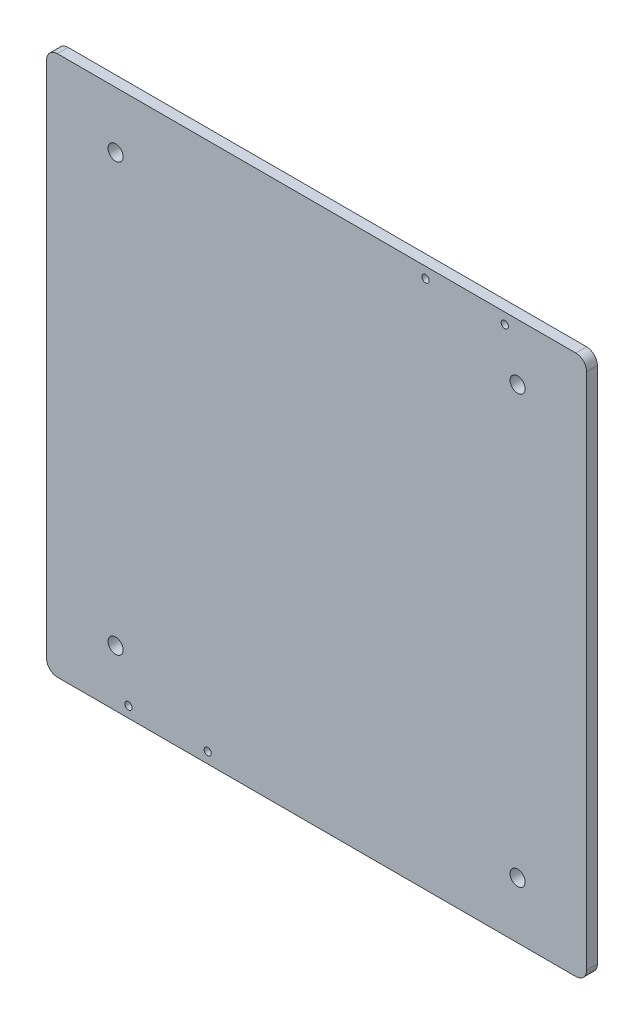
from build123d import *

# Parameters (mm, degrees)
SKETCH1_W           = 150
SKETCH1_H           = 150
BOSS_EXTRUDE1_DEPTH = 3
FILLET1_R           = 3
SKETCH2_R           = 2.1
CUT_EXTRUDE1_DEPTH  = 3
SKETCH3_R           = 1
CUT_EXTRUDE2_DEPTH  = 3


with BuildPart() as part:
    # Sketch1 → Boss-Extrude1 (new body)
    with BuildSketch(Plane.XY):
        Rectangle(SKETCH1_W, SKETCH1_H)
    extrude(amount=BOSS_EXTRUDE1_DEPTH)

    # Fillet1
    fillet1_edges = [part.edges().sort_by_distance(p)[0] for p in [
        (75, -75, 1.5),
        (-75, -75, 1.5),
        (-75, 75, 1.5),
        (75, 75, 1.5),
    ]]
    fillet(fillet1_edges, radius=FILLET1_R)

    # Sketch2 → Cut-Extrude1 (cut)
    with BuildSketch(Plane(origin=(0, 0, 0), x_dir=(-1, 0, 0), z_dir=(0, 0, -1))):
        with Locations((-55.835, 59.325)):
            Circle(SKETCH2_R)
        with Locations((55.835, 59.325)):
            Circle(SKETCH2_R)
        with Locations((-55.835, -59.325)):
            Circle(SKETCH2_R)
        with Locations((55.835, -59.325)):
            Circle(SKETCH2_R)
    extrude(amount=-CUT_EXTRUDE1_DEPTH, mode=Mode.SUBTRACT)

    # Sketch3 → Cut-Extrude2 (cut)
    with BuildSketch(Plane(origin=(0, 0, 0), x_dir=(-1, 0, 0), z_dir=(0, 0, -1))):
        with Locations((-52.26, 72)):
            Circle(SKETCH3_R)
        with Locations((-30.26, 72)):
            Circle(SKETCH3_R)
        with Locations((52.26, -72)):
            Circle(SKETCH3_R)
        with Locations((30.26, -72)):
            Circle(SKETCH3_R)
    extrude(amount=-CUT_EXTRUDE2_DEPTH, mode=Mode.SUBTRACT)


solid = part.part
